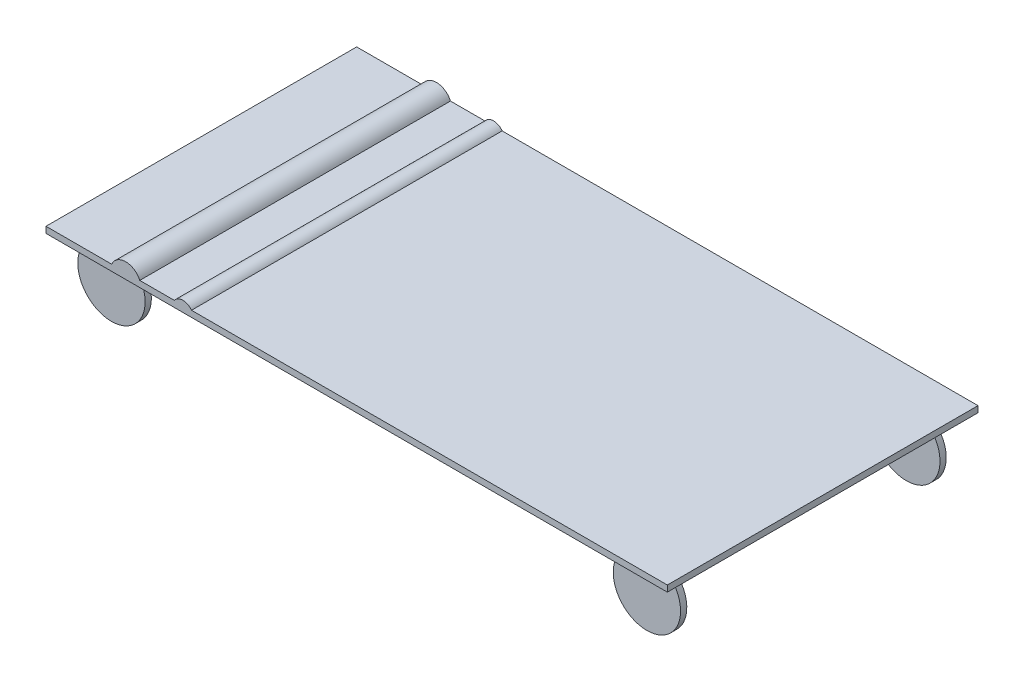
ISO-10303-21;
HEADER;
FILE_DESCRIPTION(('STEP AP214'),'2;1');
FILE_NAME('part.step','',(''),(''),'','','');
FILE_SCHEMA(('AUTOMOTIVE_DESIGN { 1 0 10303 214 1 1 1 1 }'));
ENDSEC;
DATA;
#1=APPLICATION_CONTEXT('core data for automotive mechanical design processes');
#2=APPLICATION_PROTOCOL_DEFINITION('international standard','automotive_design',2000,#1);
#3=PRODUCT_CONTEXT('',#1,'mechanical');
#4=PRODUCT('Part','Part','',(#3));
#5=PRODUCT_RELATED_PRODUCT_CATEGORY('part','',(#4));
#6=PRODUCT_DEFINITION_FORMATION('','',#4);
#7=PRODUCT_DEFINITION_CONTEXT('part definition',#1,'design');
#8=PRODUCT_DEFINITION('design','',#6,#7);
#9=PRODUCT_DEFINITION_SHAPE('','',#8);
#10=(LENGTH_UNIT() NAMED_UNIT(*) SI_UNIT(.MILLI.,.METRE.));
#11=(NAMED_UNIT(*) PLANE_ANGLE_UNIT() SI_UNIT($,.RADIAN.));
#12=(NAMED_UNIT(*) SI_UNIT($,.STERADIAN.) SOLID_ANGLE_UNIT());
#13=UNCERTAINTY_MEASURE_WITH_UNIT(LENGTH_MEASURE(1.E-05),#10,'distance_accuracy_value','');
#14=(GEOMETRIC_REPRESENTATION_CONTEXT(3) GLOBAL_UNCERTAINTY_ASSIGNED_CONTEXT((#13)) GLOBAL_UNIT_ASSIGNED_CONTEXT((#10,
#11,#12)) REPRESENTATION_CONTEXT('',''));
#15=CARTESIAN_POINT('',(0.,0.,0.));
#16=DIRECTION('',(0.,0.,1.));
#17=DIRECTION('',(1.,0.,0.));
#18=AXIS2_PLACEMENT_3D('',#15,#16,#17);
#19=CARTESIAN_POINT('',(0.,50.,0.));
#20=DIRECTION('',(0.,1.,0.));
#21=DIRECTION('',(0.,0.,1.));
#22=AXIS2_PLACEMENT_3D('',#19,#20,#21);
#23=PLANE('',#22);
#24=DIRECTION('',(-1.,0.,0.));
#25=VECTOR('',#24,1.);
#26=CARTESIAN_POINT('',(2500.,50.,-1250.));
#27=LINE('',#26,#25);
#28=CARTESIAN_POINT('',(2500.,50.,-1250.));
#29=VERTEX_POINT('',#28);
#30=CARTESIAN_POINT('',(-1329.04381429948,50.,-1250.));
#31=VERTEX_POINT('',#30);
#32=EDGE_CURVE('E157',#29,#31,#27,.T.);
#33=ORIENTED_EDGE('',*,*,#32,.T.);
#34=DIRECTION('',(0.,0.,-1.));
#35=VECTOR('',#34,1.);
#36=CARTESIAN_POINT('',(-1329.04381429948,50.,1250.));
#37=LINE('',#36,#35);
#38=CARTESIAN_POINT('',(-1329.04381429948,50.,1250.));
#39=VERTEX_POINT('',#38);
#40=EDGE_CURVE('E51',#39,#31,#37,.T.);
#41=ORIENTED_EDGE('',*,*,#40,.F.);
#42=DIRECTION('',(1.,0.,0.));
#43=VECTOR('',#42,1.);
#44=CARTESIAN_POINT('',(2500.,50.,1250.));
#45=LINE('',#44,#43);
#46=CARTESIAN_POINT('',(2500.,50.,1250.));
#47=VERTEX_POINT('',#46);
#48=EDGE_CURVE('E209',#39,#47,#45,.T.);
#49=ORIENTED_EDGE('',*,*,#48,.T.);
#50=DIRECTION('',(0.,0.,-1.));
#51=VECTOR('',#50,1.);
#52=CARTESIAN_POINT('',(2500.,50.,1250.));
#53=LINE('',#52,#51);
#54=EDGE_CURVE('E213',#47,#29,#53,.T.);
#55=ORIENTED_EDGE('',*,*,#54,.T.);
#56=EDGE_LOOP('',(#33,#41,#49,#55));
#57=FACE_BOUND('',#56,.T.);
#58=ADVANCED_FACE('F36',(#57),#23,.T.);
#59=CARTESIAN_POINT('',(-1745.31769207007,50.,1250.));
#60=VERTEX_POINT('',#59);
#61=CARTESIAN_POINT('',(-1467.15016450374,50.,1250.));
#62=VERTEX_POINT('',#61);
#63=EDGE_CURVE('E59',#60,#62,#45,.T.);
#64=ORIENTED_EDGE('',*,*,#63,.T.);
#65=DIRECTION('',(0.,0.,-1.));
#66=VECTOR('',#65,1.);
#67=CARTESIAN_POINT('',(-1467.15016450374,50.,1250.));
#68=LINE('',#67,#66);
#69=CARTESIAN_POINT('',(-1467.15016450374,50.,-1250.));
#70=VERTEX_POINT('',#69);
#71=EDGE_CURVE('E161',#62,#70,#68,.T.);
#72=ORIENTED_EDGE('',*,*,#71,.T.);
#73=CARTESIAN_POINT('',(-1745.31769207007,50.,-1250.));
#74=VERTEX_POINT('',#73);
#75=EDGE_CURVE('E149',#70,#74,#27,.T.);
#76=ORIENTED_EDGE('',*,*,#75,.T.);
#77=DIRECTION('',(0.,0.,-1.));
#78=VECTOR('',#77,1.);
#79=CARTESIAN_POINT('',(-1745.31769207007,50.,1250.));
#80=LINE('',#79,#78);
#81=EDGE_CURVE('E176',#60,#74,#80,.T.);
#82=ORIENTED_EDGE('',*,*,#81,.F.);
#83=EDGE_LOOP('',(#64,#72,#76,#82));
#84=FACE_BOUND('',#83,.T.);
#85=ADVANCED_FACE('F162',(#84),#23,.T.);
#86=CARTESIAN_POINT('',(-2500.,50.,1250.));
#87=VERTEX_POINT('',#86);
#88=CARTESIAN_POINT('',(-1971.38345897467,50.,1250.));
#89=VERTEX_POINT('',#88);
#90=EDGE_CURVE('E211',#87,#89,#45,.T.);
#91=ORIENTED_EDGE('',*,*,#90,.T.);
#92=DIRECTION('',(0.,0.,-1.));
#93=VECTOR('',#92,1.);
#94=CARTESIAN_POINT('',(-1971.38345897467,50.,1250.));
#95=LINE('',#94,#93);
#96=CARTESIAN_POINT('',(-1971.38345897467,50.,-1250.));
#97=VERTEX_POINT('',#96);
#98=EDGE_CURVE('E178',#89,#97,#95,.T.);
#99=ORIENTED_EDGE('',*,*,#98,.T.);
#100=CARTESIAN_POINT('',(-2500.,50.,-1250.));
#101=VERTEX_POINT('',#100);
#102=EDGE_CURVE('E158',#97,#101,#27,.T.);
#103=ORIENTED_EDGE('',*,*,#102,.T.);
#104=DIRECTION('',(0.,0.,1.));
#105=VECTOR('',#104,1.);
#106=CARTESIAN_POINT('',(-2500.,50.,1250.));
#107=LINE('',#106,#105);
#108=EDGE_CURVE('E206',#101,#87,#107,.T.);
#109=ORIENTED_EDGE('',*,*,#108,.T.);
#110=EDGE_LOOP('',(#91,#99,#103,#109));
#111=FACE_BOUND('',#110,.T.);
#112=ADVANCED_FACE('F296',(#111),#23,.T.);
#113=CARTESIAN_POINT('',(-2500.,50.,1250.));
#114=DIRECTION('',(1.,0.,0.));
#115=DIRECTION('',(0.,0.,-1.));
#116=AXIS2_PLACEMENT_3D('',#113,#114,#115);
#117=PLANE('',#116);
#118=DIRECTION('',(0.,0.,1.));
#119=VECTOR('',#118,1.);
#120=CARTESIAN_POINT('',(-2500.,0.,1250.));
#121=LINE('',#120,#119);
#122=CARTESIAN_POINT('',(-2500.,0.,-1250.));
#123=VERTEX_POINT('',#122);
#124=CARTESIAN_POINT('',(-2500.,0.,1250.));
#125=VERTEX_POINT('',#124);
#126=EDGE_CURVE('E203',#123,#125,#121,.T.);
#127=ORIENTED_EDGE('',*,*,#126,.T.);
#128=DIRECTION('',(0.,-1.,0.));
#129=VECTOR('',#128,1.);
#130=CARTESIAN_POINT('',(-2500.,50.,1250.));
#131=LINE('',#130,#129);
#132=EDGE_CURVE('E231',#87,#125,#131,.T.);
#133=ORIENTED_EDGE('',*,*,#132,.F.);
#134=ORIENTED_EDGE('',*,*,#108,.F.);
#135=DIRECTION('',(0.,-1.,0.));
#136=VECTOR('',#135,1.);
#137=CARTESIAN_POINT('',(-2500.,50.,-1250.));
#138=LINE('',#137,#136);
#139=EDGE_CURVE('E215',#101,#123,#138,.T.);
#140=ORIENTED_EDGE('',*,*,#139,.T.);
#141=EDGE_LOOP('',(#127,#133,#134,#140));
#142=FACE_BOUND('',#141,.T.);
#143=ADVANCED_FACE('F38',(#142),#117,.F.);
#144=CARTESIAN_POINT('',(2500.,50.,1250.));
#145=DIRECTION('',(0.,0.,-1.));
#146=DIRECTION('',(-1.,0.,0.));
#147=AXIS2_PLACEMENT_3D('',#144,#145,#146);
#148=PLANE('',#147);
#149=DIRECTION('',(1.,0.,0.));
#150=VECTOR('',#149,1.);
#151=CARTESIAN_POINT('',(2500.,0.,1250.));
#152=LINE('',#151,#150);
#153=CARTESIAN_POINT('',(2500.,0.,1250.));
#154=VERTEX_POINT('',#153);
#155=EDGE_CURVE('E218',#125,#154,#152,.T.);
#156=ORIENTED_EDGE('',*,*,#155,.T.);
#157=DIRECTION('',(0.,-1.,0.));
#158=VECTOR('',#157,1.);
#159=CARTESIAN_POINT('',(2500.,50.,1250.));
#160=LINE('',#159,#158);
#161=EDGE_CURVE('E228',#47,#154,#160,.T.);
#162=ORIENTED_EDGE('',*,*,#161,.F.);
#163=ORIENTED_EDGE('',*,*,#48,.F.);
#164=CARTESIAN_POINT('',(-1398.09698940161,0.,1250.));
#165=DIRECTION('',(0.,0.,1.));
#166=DIRECTION('',(1.,0.,0.));
#167=AXIS2_PLACEMENT_3D('',#164,#165,#166);
#168=CIRCLE('',#167,85.2545658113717);
#169=EDGE_CURVE('E167',#39,#62,#168,.T.);
#170=ORIENTED_EDGE('',*,*,#169,.T.);
#171=ORIENTED_EDGE('',*,*,#63,.F.);
#172=CARTESIAN_POINT('',(-1858.35057552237,0.,1250.));
#173=DIRECTION('',(0.,0.,1.));
#174=DIRECTION('',(1.,0.,0.));
#175=AXIS2_PLACEMENT_3D('',#172,#173,#174);
#176=CIRCLE('',#175,123.59786705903);
#177=EDGE_CURVE('E173',#60,#89,#176,.T.);
#178=ORIENTED_EDGE('',*,*,#177,.T.);
#179=ORIENTED_EDGE('',*,*,#90,.F.);
#180=ORIENTED_EDGE('',*,*,#132,.T.);
#181=EDGE_LOOP('',(#156,#162,#163,#170,#171,#178,#179,#180));
#182=FACE_BOUND('',#181,.T.);
#183=ADVANCED_FACE('F307',(#182),#148,.F.);
#184=CARTESIAN_POINT('',(2500.,50.,1250.));
#185=DIRECTION('',(-1.,0.,0.));
#186=DIRECTION('',(0.,0.,1.));
#187=AXIS2_PLACEMENT_3D('',#184,#185,#186);
#188=PLANE('',#187);
#189=DIRECTION('',(0.,0.,-1.));
#190=VECTOR('',#189,1.);
#191=CARTESIAN_POINT('',(2500.,0.,1250.));
#192=LINE('',#191,#190);
#193=CARTESIAN_POINT('',(2500.,0.,-1250.));
#194=VERTEX_POINT('',#193);
#195=EDGE_CURVE('E220',#154,#194,#192,.T.);
#196=ORIENTED_EDGE('',*,*,#195,.T.);
#197=DIRECTION('',(0.,-1.,0.));
#198=VECTOR('',#197,1.);
#199=CARTESIAN_POINT('',(2500.,50.,-1250.));
#200=LINE('',#199,#198);
#201=EDGE_CURVE('E225',#29,#194,#200,.T.);
#202=ORIENTED_EDGE('',*,*,#201,.F.);
#203=ORIENTED_EDGE('',*,*,#54,.F.);
#204=ORIENTED_EDGE('',*,*,#161,.T.);
#205=EDGE_LOOP('',(#196,#202,#203,#204));
#206=FACE_BOUND('',#205,.T.);
#207=ADVANCED_FACE('F335',(#206),#188,.F.);
#208=CARTESIAN_POINT('',(2500.,50.,-1250.));
#209=DIRECTION('',(0.,0.,1.));
#210=DIRECTION('',(1.,0.,0.));
#211=AXIS2_PLACEMENT_3D('',#208,#209,#210);
#212=PLANE('',#211);
#213=DIRECTION('',(-1.,0.,0.));
#214=VECTOR('',#213,1.);
#215=CARTESIAN_POINT('',(2500.,0.,-1250.));
#216=LINE('',#215,#214);
#217=EDGE_CURVE('E210',#194,#123,#216,.T.);
#218=ORIENTED_EDGE('',*,*,#217,.T.);
#219=ORIENTED_EDGE('',*,*,#139,.F.);
#220=ORIENTED_EDGE('',*,*,#102,.F.);
#221=CARTESIAN_POINT('',(-1858.35057552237,0.,-1250.));
#222=DIRECTION('',(0.,0.,1.));
#223=DIRECTION('',(1.,0.,0.));
#224=AXIS2_PLACEMENT_3D('',#221,#222,#223);
#225=CIRCLE('',#224,123.59786705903);
#226=EDGE_CURVE('E155',#74,#97,#225,.T.);
#227=ORIENTED_EDGE('',*,*,#226,.F.);
#228=ORIENTED_EDGE('',*,*,#75,.F.);
#229=CARTESIAN_POINT('',(-1398.09698940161,0.,-1250.));
#230=DIRECTION('',(0.,0.,1.));
#231=DIRECTION('',(1.,0.,0.));
#232=AXIS2_PLACEMENT_3D('',#229,#230,#231);
#233=CIRCLE('',#232,85.2545658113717);
#234=EDGE_CURVE('E153',#31,#70,#233,.T.);
#235=ORIENTED_EDGE('',*,*,#234,.F.);
#236=ORIENTED_EDGE('',*,*,#32,.F.);
#237=ORIENTED_EDGE('',*,*,#201,.T.);
#238=EDGE_LOOP('',(#218,#219,#220,#227,#228,#235,#236,#237));
#239=FACE_BOUND('',#238,.T.);
#240=ADVANCED_FACE('F150',(#239),#212,.F.);
#241=CARTESIAN_POINT('',(0.,0.,0.));
#242=DIRECTION('',(0.,1.,0.));
#243=DIRECTION('',(0.,0.,1.));
#244=AXIS2_PLACEMENT_3D('',#241,#242,#243);
#245=PLANE('',#244);
#246=DIRECTION('',(0.,0.,-1.));
#247=VECTOR('',#246,1.);
#248=CARTESIAN_POINT('',(2077.24887980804,0.,1068.79738550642));
#249=LINE('',#248,#247);
#250=CARTESIAN_POINT('',(2077.24887980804,0.,1018.79738550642));
#251=VERTEX_POINT('',#250);
#252=CARTESIAN_POINT('',(2077.24887980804,0.,1068.79738550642));
#253=VERTEX_POINT('',#252);
#254=EDGE_CURVE('E268',#251,#253,#249,.F.);
#255=ORIENTED_EDGE('',*,*,#254,.T.);
#256=DIRECTION('',(1.,0.,0.));
#257=VECTOR('',#256,1.);
#258=CARTESIAN_POINT('',(0.,0.,1068.79738550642));
#259=LINE('',#258,#257);
#260=CARTESIAN_POINT('',(2231.74202126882,0.,1068.79738550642));
#261=VERTEX_POINT('',#260);
#262=EDGE_CURVE('E11',#253,#261,#259,.T.);
#263=ORIENTED_EDGE('',*,*,#262,.T.);
#264=DIRECTION('',(0.,0.,-1.));
#265=VECTOR('',#264,1.);
#266=CARTESIAN_POINT('',(2231.74202126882,0.,1068.79738550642));
#267=LINE('',#266,#265);
#268=CARTESIAN_POINT('',(2231.74202126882,0.,1018.79738550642));
#269=VERTEX_POINT('',#268);
#270=EDGE_CURVE('E44',#261,#269,#267,.T.);
#271=ORIENTED_EDGE('',*,*,#270,.T.);
#272=DIRECTION('',(1.,0.,0.));
#273=VECTOR('',#272,1.);
#274=CARTESIAN_POINT('',(0.,0.,1018.79738550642));
#275=LINE('',#274,#273);
#276=EDGE_CURVE('E265',#251,#269,#275,.T.);
#277=ORIENTED_EDGE('',*,*,#276,.F.);
#278=EDGE_LOOP('',(#255,#263,#271,#277));
#279=FACE_BOUND('',#278,.T.);
#280=DIRECTION('',(0.,0.,1.));
#281=VECTOR('',#280,1.);
#282=CARTESIAN_POINT('',(2231.74202126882,0.,-1068.79738550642));
#283=LINE('',#282,#281);
#284=CARTESIAN_POINT('',(2231.74202126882,0.,-1068.79738550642));
#285=VERTEX_POINT('',#284);
#286=CARTESIAN_POINT('',(2231.74202126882,0.,-1018.79738550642));
#287=VERTEX_POINT('',#286);
#288=EDGE_CURVE('E257',#285,#287,#283,.T.);
#289=ORIENTED_EDGE('',*,*,#288,.F.);
#290=DIRECTION('',(-1.,0.,0.));
#291=VECTOR('',#290,1.);
#292=CARTESIAN_POINT('',(0.,0.,-1068.79738550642));
#293=LINE('',#292,#291);
#294=CARTESIAN_POINT('',(2077.24887980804,0.,-1068.79738550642));
#295=VERTEX_POINT('',#294);
#296=EDGE_CURVE('E263',#285,#295,#293,.T.);
#297=ORIENTED_EDGE('',*,*,#296,.T.);
#298=DIRECTION('',(0.,0.,1.));
#299=VECTOR('',#298,1.);
#300=CARTESIAN_POINT('',(2077.24887980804,0.,-1068.79738550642));
#301=LINE('',#300,#299);
#302=CARTESIAN_POINT('',(2077.24887980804,0.,-1018.79738550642));
#303=VERTEX_POINT('',#302);
#304=EDGE_CURVE('E260',#303,#295,#301,.F.);
#305=ORIENTED_EDGE('',*,*,#304,.F.);
#306=DIRECTION('',(-1.,0.,0.));
#307=VECTOR('',#306,1.);
#308=CARTESIAN_POINT('',(0.,0.,-1018.79738550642));
#309=LINE('',#308,#307);
#310=EDGE_CURVE('E254',#287,#303,#309,.T.);
#311=ORIENTED_EDGE('',*,*,#310,.F.);
#312=EDGE_LOOP('',(#289,#297,#305,#311));
#313=FACE_BOUND('',#312,.T.);
#314=DIRECTION('',(0.,0.,1.));
#315=VECTOR('',#314,1.);
#316=CARTESIAN_POINT('',(-2077.24887980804,0.,-1068.79738550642));
#317=LINE('',#316,#315);
#318=CARTESIAN_POINT('',(-2077.24887980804,0.,-1018.79738550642));
#319=VERTEX_POINT('',#318);
#320=CARTESIAN_POINT('',(-2077.24887980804,0.,-1068.79738550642));
#321=VERTEX_POINT('',#320);
#322=EDGE_CURVE('E248',#319,#321,#317,.F.);
#323=ORIENTED_EDGE('',*,*,#322,.T.);
#324=DIRECTION('',(-1.,0.,0.));
#325=VECTOR('',#324,1.);
#326=CARTESIAN_POINT('',(0.,0.,-1068.79738550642));
#327=LINE('',#326,#325);
#328=CARTESIAN_POINT('',(-2231.74202126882,0.,-1068.79738550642));
#329=VERTEX_POINT('',#328);
#330=EDGE_CURVE('E252',#321,#329,#327,.T.);
#331=ORIENTED_EDGE('',*,*,#330,.T.);
#332=DIRECTION('',(0.,0.,1.));
#333=VECTOR('',#332,1.);
#334=CARTESIAN_POINT('',(-2231.74202126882,0.,-1068.79738550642));
#335=LINE('',#334,#333);
#336=CARTESIAN_POINT('',(-2231.74202126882,0.,-1018.79738550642));
#337=VERTEX_POINT('',#336);
#338=EDGE_CURVE('E250',#329,#337,#335,.T.);
#339=ORIENTED_EDGE('',*,*,#338,.T.);
#340=DIRECTION('',(-1.,0.,0.));
#341=VECTOR('',#340,1.);
#342=CARTESIAN_POINT('',(0.,0.,-1018.79738550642));
#343=LINE('',#342,#341);
#344=EDGE_CURVE('E245',#319,#337,#343,.T.);
#345=ORIENTED_EDGE('',*,*,#344,.F.);
#346=EDGE_LOOP('',(#323,#331,#339,#345));
#347=FACE_BOUND('',#346,.T.);
#348=DIRECTION('',(0.,0.,-1.));
#349=VECTOR('',#348,1.);
#350=CARTESIAN_POINT('',(-2231.74202126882,0.,1068.79738550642));
#351=LINE('',#350,#349);
#352=CARTESIAN_POINT('',(-2231.74202126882,0.,1068.79738550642));
#353=VERTEX_POINT('',#352);
#354=CARTESIAN_POINT('',(-2231.74202126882,0.,1018.79738550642));
#355=VERTEX_POINT('',#354);
#356=EDGE_CURVE('E237',#353,#355,#351,.T.);
#357=ORIENTED_EDGE('',*,*,#356,.F.);
#358=DIRECTION('',(1.,0.,0.));
#359=VECTOR('',#358,1.);
#360=CARTESIAN_POINT('',(0.,0.,1068.79738550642));
#361=LINE('',#360,#359);
#362=CARTESIAN_POINT('',(-2077.24887980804,0.,1068.79738550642));
#363=VERTEX_POINT('',#362);
#364=EDGE_CURVE('E243',#353,#363,#361,.T.);
#365=ORIENTED_EDGE('',*,*,#364,.T.);
#366=DIRECTION('',(0.,0.,-1.));
#367=VECTOR('',#366,1.);
#368=CARTESIAN_POINT('',(-2077.24887980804,0.,1068.79738550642));
#369=LINE('',#368,#367);
#370=CARTESIAN_POINT('',(-2077.24887980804,0.,1018.79738550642));
#371=VERTEX_POINT('',#370);
#372=EDGE_CURVE('E240',#371,#363,#369,.F.);
#373=ORIENTED_EDGE('',*,*,#372,.F.);
#374=DIRECTION('',(1.,0.,0.));
#375=VECTOR('',#374,1.);
#376=CARTESIAN_POINT('',(0.,0.,1018.79738550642));
#377=LINE('',#376,#375);
#378=EDGE_CURVE('E234',#355,#371,#377,.T.);
#379=ORIENTED_EDGE('',*,*,#378,.F.);
#380=EDGE_LOOP('',(#357,#365,#373,#379));
#381=FACE_BOUND('',#380,.T.);
#382=ORIENTED_EDGE('',*,*,#126,.F.);
#383=ORIENTED_EDGE('',*,*,#217,.F.);
#384=ORIENTED_EDGE('',*,*,#195,.F.);
#385=ORIENTED_EDGE('',*,*,#155,.F.);
#386=EDGE_LOOP('',(#382,#383,#384,#385));
#387=FACE_BOUND('',#386,.T.);
#388=ADVANCED_FACE('F271',(#279,#313,#347,#381,#387),#245,.F.);
#389=CARTESIAN_POINT('',(-2154.49545053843,-259.790798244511,1068.79738550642));
#390=DIRECTION('',(0.,0.,-1.));
#391=DIRECTION('',(-1.,0.,0.));
#392=AXIS2_PLACEMENT_3D('',#389,#390,#391);
#393=CYLINDRICAL_SURFACE('',#392,271.031901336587);
#394=CARTESIAN_POINT('',(-2154.49545053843,-259.790798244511,1018.79738550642));
#395=DIRECTION('',(0.,0.,1.));
#396=DIRECTION('',(1.,0.,0.));
#397=AXIS2_PLACEMENT_3D('',#394,#395,#396);
#398=CIRCLE('',#397,271.031901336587);
#399=EDGE_CURVE('E197',#355,#371,#398,.T.);
#400=ORIENTED_EDGE('',*,*,#399,.T.);
#401=ORIENTED_EDGE('',*,*,#372,.T.);
#402=CARTESIAN_POINT('',(-2154.49545053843,-259.790798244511,1068.79738550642));
#403=DIRECTION('',(0.,0.,1.));
#404=DIRECTION('',(1.,0.,0.));
#405=AXIS2_PLACEMENT_3D('',#402,#403,#404);
#406=CIRCLE('',#405,271.031901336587);
#407=EDGE_CURVE('E200',#353,#363,#406,.T.);
#408=ORIENTED_EDGE('',*,*,#407,.F.);
#409=ORIENTED_EDGE('',*,*,#356,.T.);
#410=EDGE_LOOP('',(#400,#401,#408,#409));
#411=FACE_BOUND('',#410,.T.);
#412=ADVANCED_FACE('F416',(#411),#393,.T.);
#413=CARTESIAN_POINT('',(-2154.49545053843,-259.790798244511,1068.79738550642));
#414=DIRECTION('',(0.,0.,1.));
#415=DIRECTION('',(1.,0.,0.));
#416=AXIS2_PLACEMENT_3D('',#413,#414,#415);
#417=PLANE('',#416);
#418=ORIENTED_EDGE('',*,*,#364,.F.);
#419=ORIENTED_EDGE('',*,*,#407,.T.);
#420=EDGE_LOOP('',(#418,#419));
#421=FACE_BOUND('',#420,.T.);
#422=ADVANCED_FACE('F455',(#421),#417,.T.);
#423=CARTESIAN_POINT('',(-2154.49545053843,-259.790798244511,1018.79738550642));
#424=DIRECTION('',(0.,0.,1.));
#425=DIRECTION('',(1.,0.,0.));
#426=AXIS2_PLACEMENT_3D('',#423,#424,#425);
#427=PLANE('',#426);
#428=ORIENTED_EDGE('',*,*,#399,.F.);
#429=ORIENTED_EDGE('',*,*,#378,.T.);
#430=EDGE_LOOP('',(#428,#429));
#431=FACE_BOUND('',#430,.T.);
#432=ADVANCED_FACE('F445',(#431),#427,.F.);
#433=CARTESIAN_POINT('',(-2154.49545053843,-259.790798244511,-1068.79738550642));
#434=DIRECTION('',(0.,0.,1.));
#435=DIRECTION('',(1.,0.,0.));
#436=AXIS2_PLACEMENT_3D('',#433,#434,#435);
#437=CYLINDRICAL_SURFACE('',#436,271.031901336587);
#438=ORIENTED_EDGE('',*,*,#338,.F.);
#439=CARTESIAN_POINT('',(-2154.49545053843,-259.790798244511,-1068.79738550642));
#440=DIRECTION('',(0.,0.,1.));
#441=DIRECTION('',(1.,0.,0.));
#442=AXIS2_PLACEMENT_3D('',#439,#440,#441);
#443=CIRCLE('',#442,271.031901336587);
#444=EDGE_CURVE('E194',#329,#321,#443,.T.);
#445=ORIENTED_EDGE('',*,*,#444,.T.);
#446=ORIENTED_EDGE('',*,*,#322,.F.);
#447=CARTESIAN_POINT('',(-2154.49545053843,-259.790798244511,-1018.79738550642));
#448=DIRECTION('',(0.,0.,1.));
#449=DIRECTION('',(1.,0.,0.));
#450=AXIS2_PLACEMENT_3D('',#447,#448,#449);
#451=CIRCLE('',#450,271.031901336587);
#452=EDGE_CURVE('E191',#337,#319,#451,.T.);
#453=ORIENTED_EDGE('',*,*,#452,.F.);
#454=EDGE_LOOP('',(#438,#445,#446,#453));
#455=FACE_BOUND('',#454,.T.);
#456=ADVANCED_FACE('F435',(#455),#437,.T.);
#457=CARTESIAN_POINT('',(-2154.49545053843,-259.790798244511,-1068.79738550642));
#458=DIRECTION('',(0.,0.,-1.));
#459=DIRECTION('',(1.,0.,0.));
#460=AXIS2_PLACEMENT_3D('',#457,#458,#459);
#461=PLANE('',#460);
#462=ORIENTED_EDGE('',*,*,#330,.F.);
#463=ORIENTED_EDGE('',*,*,#444,.F.);
#464=EDGE_LOOP('',(#462,#463));
#465=FACE_BOUND('',#464,.T.);
#466=ADVANCED_FACE('F425',(#465),#461,.T.);
#467=CARTESIAN_POINT('',(-2154.49545053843,-259.790798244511,-1018.79738550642));
#468=DIRECTION('',(0.,0.,-1.));
#469=DIRECTION('',(1.,0.,0.));
#470=AXIS2_PLACEMENT_3D('',#467,#468,#469);
#471=PLANE('',#470);
#472=ORIENTED_EDGE('',*,*,#452,.T.);
#473=ORIENTED_EDGE('',*,*,#344,.T.);
#474=EDGE_LOOP('',(#472,#473));
#475=FACE_BOUND('',#474,.T.);
#476=ADVANCED_FACE('F405',(#475),#471,.F.);
#477=CARTESIAN_POINT('',(2154.49545053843,-259.790798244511,-1068.79738550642));
#478=DIRECTION('',(0.,0.,1.));
#479=DIRECTION('',(1.,0.,0.));
#480=AXIS2_PLACEMENT_3D('',#477,#478,#479);
#481=CYLINDRICAL_SURFACE('',#480,271.031901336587);
#482=CARTESIAN_POINT('',(2154.49545053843,-259.790798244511,-1018.79738550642));
#483=DIRECTION('',(0.,0.,-1.));
#484=DIRECTION('',(-1.,0.,0.));
#485=AXIS2_PLACEMENT_3D('',#482,#483,#484);
#486=CIRCLE('',#485,271.031901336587);
#487=EDGE_CURVE('E185',#287,#303,#486,.T.);
#488=ORIENTED_EDGE('',*,*,#487,.T.);
#489=ORIENTED_EDGE('',*,*,#304,.T.);
#490=CARTESIAN_POINT('',(2154.49545053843,-259.790798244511,-1068.79738550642));
#491=DIRECTION('',(0.,0.,-1.));
#492=DIRECTION('',(-1.,0.,0.));
#493=AXIS2_PLACEMENT_3D('',#490,#491,#492);
#494=CIRCLE('',#493,271.031901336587);
#495=EDGE_CURVE('E188',#285,#295,#494,.T.);
#496=ORIENTED_EDGE('',*,*,#495,.F.);
#497=ORIENTED_EDGE('',*,*,#288,.T.);
#498=EDGE_LOOP('',(#488,#489,#496,#497));
#499=FACE_BOUND('',#498,.T.);
#500=ADVANCED_FACE('F395',(#499),#481,.T.);
#501=CARTESIAN_POINT('',(2154.49545053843,-259.790798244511,-1068.79738550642));
#502=DIRECTION('',(0.,0.,-1.));
#503=DIRECTION('',(-1.,0.,0.));
#504=AXIS2_PLACEMENT_3D('',#501,#502,#503);
#505=PLANE('',#504);
#506=ORIENTED_EDGE('',*,*,#296,.F.);
#507=ORIENTED_EDGE('',*,*,#495,.T.);
#508=EDGE_LOOP('',(#506,#507));
#509=FACE_BOUND('',#508,.T.);
#510=ADVANCED_FACE('F385',(#509),#505,.T.);
#511=CARTESIAN_POINT('',(2154.49545053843,-259.790798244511,-1018.79738550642));
#512=DIRECTION('',(0.,0.,-1.));
#513=DIRECTION('',(-1.,0.,0.));
#514=AXIS2_PLACEMENT_3D('',#511,#512,#513);
#515=PLANE('',#514);
#516=ORIENTED_EDGE('',*,*,#487,.F.);
#517=ORIENTED_EDGE('',*,*,#310,.T.);
#518=EDGE_LOOP('',(#516,#517));
#519=FACE_BOUND('',#518,.T.);
#520=ADVANCED_FACE('F291',(#519),#515,.F.);
#521=CARTESIAN_POINT('',(2154.49545053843,-259.790798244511,1068.79738550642));
#522=DIRECTION('',(0.,0.,-1.));
#523=DIRECTION('',(-1.,0.,0.));
#524=AXIS2_PLACEMENT_3D('',#521,#522,#523);
#525=CYLINDRICAL_SURFACE('',#524,271.031901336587);
#526=ORIENTED_EDGE('',*,*,#270,.F.);
#527=CARTESIAN_POINT('',(2154.49545053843,-259.790798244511,1068.79738550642));
#528=DIRECTION('',(0.,0.,-1.));
#529=DIRECTION('',(-1.,0.,0.));
#530=AXIS2_PLACEMENT_3D('',#527,#528,#529);
#531=CIRCLE('',#530,271.031901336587);
#532=EDGE_CURVE('E182',#261,#253,#531,.T.);
#533=ORIENTED_EDGE('',*,*,#532,.T.);
#534=ORIENTED_EDGE('',*,*,#254,.F.);
#535=CARTESIAN_POINT('',(2154.49545053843,-259.790798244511,1018.79738550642));
#536=DIRECTION('',(0.,0.,-1.));
#537=DIRECTION('',(-1.,0.,0.));
#538=AXIS2_PLACEMENT_3D('',#535,#536,#537);
#539=CIRCLE('',#538,271.031901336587);
#540=EDGE_CURVE('E181',#269,#251,#539,.T.);
#541=ORIENTED_EDGE('',*,*,#540,.F.);
#542=EDGE_LOOP('',(#526,#533,#534,#541));
#543=FACE_BOUND('',#542,.T.);
#544=ADVANCED_FACE('F280',(#543),#525,.T.);
#545=CARTESIAN_POINT('',(2154.49545053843,-259.790798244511,1068.79738550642));
#546=DIRECTION('',(0.,0.,1.));
#547=DIRECTION('',(-1.,0.,0.));
#548=AXIS2_PLACEMENT_3D('',#545,#546,#547);
#549=PLANE('',#548);
#550=ORIENTED_EDGE('',*,*,#262,.F.);
#551=ORIENTED_EDGE('',*,*,#532,.F.);
#552=EDGE_LOOP('',(#550,#551));
#553=FACE_BOUND('',#552,.T.);
#554=ADVANCED_FACE('F282',(#553),#549,.T.);
#555=CARTESIAN_POINT('',(2154.49545053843,-259.790798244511,1018.79738550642));
#556=DIRECTION('',(0.,0.,1.));
#557=DIRECTION('',(-1.,0.,0.));
#558=AXIS2_PLACEMENT_3D('',#555,#556,#557);
#559=PLANE('',#558);
#560=ORIENTED_EDGE('',*,*,#540,.T.);
#561=ORIENTED_EDGE('',*,*,#276,.T.);
#562=EDGE_LOOP('',(#560,#561));
#563=FACE_BOUND('',#562,.T.);
#564=ADVANCED_FACE('F279',(#563),#559,.F.);
#565=CARTESIAN_POINT('',(-1858.35057552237,0.,1250.));
#566=DIRECTION('',(0.,0.,-1.));
#567=DIRECTION('',(-1.,0.,0.));
#568=AXIS2_PLACEMENT_3D('',#565,#566,#567);
#569=CYLINDRICAL_SURFACE('',#568,123.59786705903);
#570=ORIENTED_EDGE('',*,*,#81,.T.);
#571=ORIENTED_EDGE('',*,*,#226,.T.);
#572=ORIENTED_EDGE('',*,*,#98,.F.);
#573=ORIENTED_EDGE('',*,*,#177,.F.);
#574=EDGE_LOOP('',(#570,#571,#572,#573));
#575=FACE_BOUND('',#574,.T.);
#576=ADVANCED_FACE('F289',(#575),#569,.T.);
#577=CARTESIAN_POINT('',(-1398.09698940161,0.,1250.));
#578=DIRECTION('',(0.,0.,-1.));
#579=DIRECTION('',(-1.,0.,0.));
#580=AXIS2_PLACEMENT_3D('',#577,#578,#579);
#581=CYLINDRICAL_SURFACE('',#580,85.2545658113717);
#582=ORIENTED_EDGE('',*,*,#40,.T.);
#583=ORIENTED_EDGE('',*,*,#234,.T.);
#584=ORIENTED_EDGE('',*,*,#71,.F.);
#585=ORIENTED_EDGE('',*,*,#169,.F.);
#586=EDGE_LOOP('',(#582,#583,#584,#585));
#587=FACE_BOUND('',#586,.T.);
#588=ADVANCED_FACE('F166',(#587),#581,.T.);
#589=CLOSED_SHELL('',(#58,#85,#112,#143,#183,#207,#240,#388,#412,#422,#432,#456,#466,#476,#500,
#510,#520,#544,#554,#564,#576,#588));
#590=MANIFOLD_SOLID_BREP('B2',#589);
#591=ADVANCED_BREP_SHAPE_REPRESENTATION('',(#18,#590),#14);
#592=SHAPE_DEFINITION_REPRESENTATION(#9,#591);
ENDSEC;
END-ISO-10303-21;
